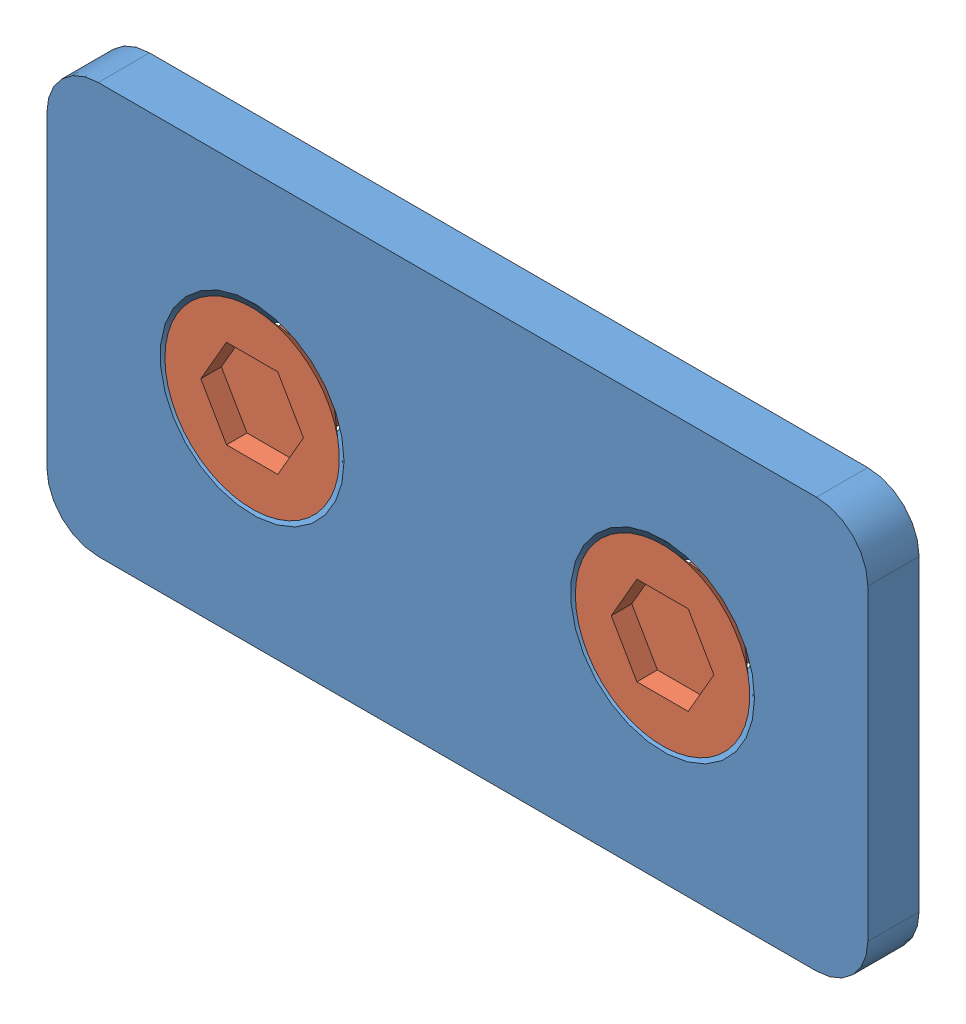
SolidWorks assembly Ensamblaje3.sldasm, configuration Predeterminado (file format 3800). Lengths in mm.
Overall size (80 40 20).
3 component instances, 2 part files, 0 mates.
Components (placement in the parent):
- Llanta de 40x80-1: Llanta de 40x80.SLDPRT [Predeterminado] at origin size (80 40 5)
- X-Tornillos abellanados  M8 x16-1: X-Tornillos abellanados  M8 x16.SLDPRT [Predeterminado] at (-20 0 -15) x (1 0 0) z (0 -1 0) size (17 20 17)
- X-Tornillos abellanados  M8 x16-2: X-Tornillos abellanados  M8 x16.SLDPRT [Predeterminado] at (20 0 -15) x (1 0 0) z (0 -1 0) size (17 20 17)
